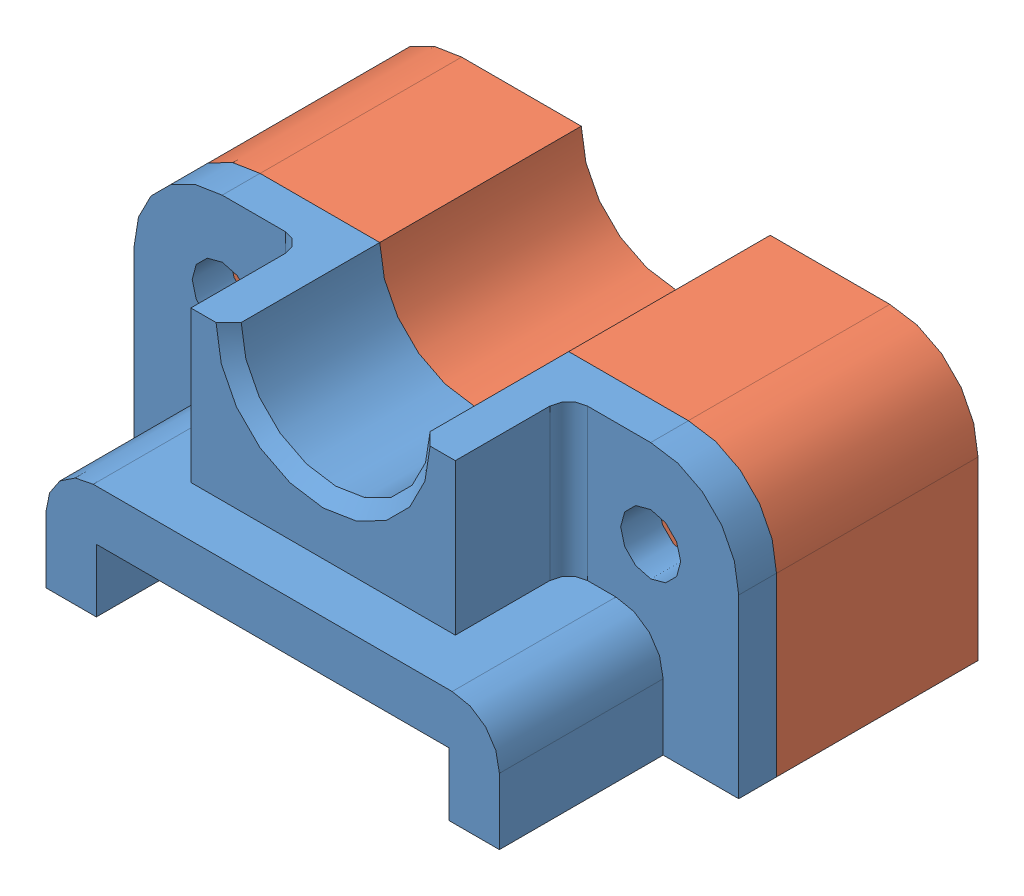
SolidWorks assembly Bearing Block Assembly.SLDASM, configuration Default (file format 3800). Lengths in mm.
Overall size (101.6 44.45 67.73).
2 component instances, 2 part files, 3 mates.
Components (placement in the parent):
- Bearing Rest-1: Bearing Rest.SLDPRT [Default] at origin size (101.6 44.45 33.87)
- Bearing Block-2: Bearing Block.SLDPRT [Default] at (101.6 0 0) size (101.6 44.45 33.87)
Mates (geometry in assembly coordinates):
- Coincident1: coincident anti-aligned: plane of Bearing Rest-1 through (0 0 0) normal (0 0 -1); plane of Bearing Block-2 through (86.7833 29.6333 0) normal (0 0 1)
- Coincident3: coincident aligned: plane of Bearing Block-2 through (34.925 44.45 -33.8667) normal (0 1 0); plane of Bearing Rest-1 through (101.6 44.45 6.35) normal (0 1 0)
- Concentric1: concentric aligned: cylinder of Bearing Rest-1; cylinder of Bearing Block-2
